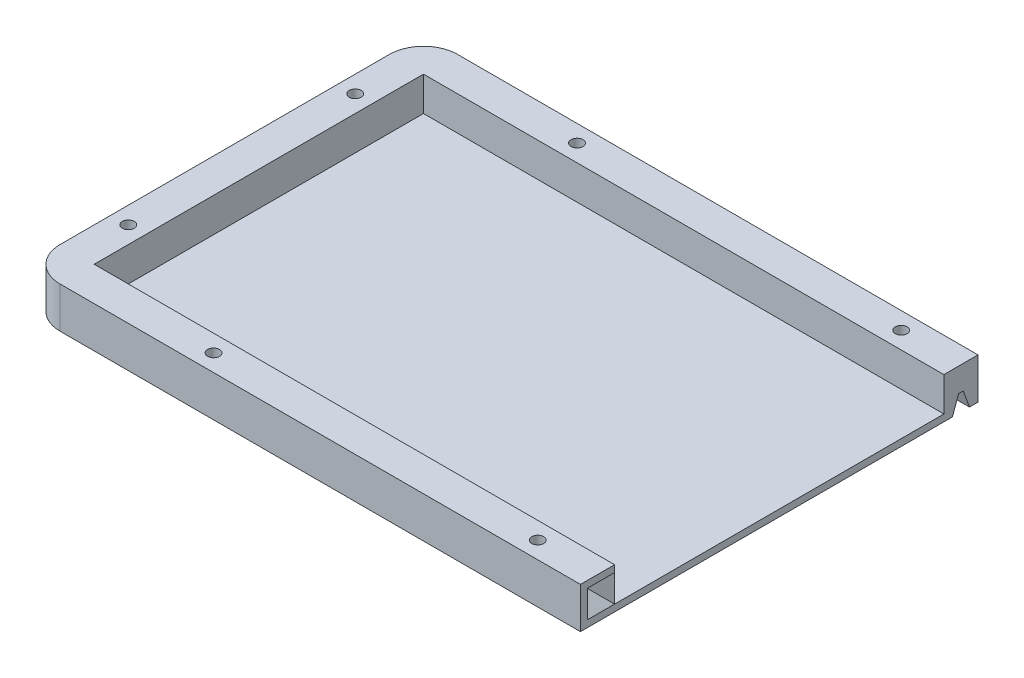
ISO-10303-21;
HEADER;
FILE_DESCRIPTION(('STEP AP214'),'2;1');
FILE_NAME('part.step','',(''),(''),'','','');
FILE_SCHEMA(('AUTOMOTIVE_DESIGN { 1 0 10303 214 1 1 1 1 }'));
ENDSEC;
DATA;
#1=APPLICATION_CONTEXT('core data for automotive mechanical design processes');
#2=APPLICATION_PROTOCOL_DEFINITION('international standard','automotive_design',2000,#1);
#3=PRODUCT_CONTEXT('',#1,'mechanical');
#4=PRODUCT('Part','Part','',(#3));
#5=PRODUCT_RELATED_PRODUCT_CATEGORY('part','',(#4));
#6=PRODUCT_DEFINITION_FORMATION('','',#4);
#7=PRODUCT_DEFINITION_CONTEXT('part definition',#1,'design');
#8=PRODUCT_DEFINITION('design','',#6,#7);
#9=PRODUCT_DEFINITION_SHAPE('','',#8);
#10=(LENGTH_UNIT() NAMED_UNIT(*) SI_UNIT(.MILLI.,.METRE.));
#11=(NAMED_UNIT(*) PLANE_ANGLE_UNIT() SI_UNIT($,.RADIAN.));
#12=(NAMED_UNIT(*) SI_UNIT($,.STERADIAN.) SOLID_ANGLE_UNIT());
#13=UNCERTAINTY_MEASURE_WITH_UNIT(LENGTH_MEASURE(1.E-05),#10,'distance_accuracy_value','');
#14=(GEOMETRIC_REPRESENTATION_CONTEXT(3) GLOBAL_UNCERTAINTY_ASSIGNED_CONTEXT((#13)) GLOBAL_UNIT_ASSIGNED_CONTEXT((#10,
#11,#12)) REPRESENTATION_CONTEXT('',''));
#15=CARTESIAN_POINT('',(0.,0.,0.));
#16=DIRECTION('',(0.,0.,1.));
#17=DIRECTION('',(1.,0.,0.));
#18=AXIS2_PLACEMENT_3D('',#15,#16,#17);
#19=CARTESIAN_POINT('',(162.5,2.,0.));
#20=DIRECTION('',(-1.,0.,0.));
#21=DIRECTION('',(0.,0.,1.));
#22=AXIS2_PLACEMENT_3D('',#19,#20,#21);
#23=PLANE('',#22);
#24=DIRECTION('',(0.,0.,1.));
#25=VECTOR('',#24,1.);
#26=CARTESIAN_POINT('',(162.5,5.,-109.));
#27=LINE('',#26,#25);
#28=CARTESIAN_POINT('',(162.5,5.,-112.180148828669));
#29=VERTEX_POINT('',#28);
#30=CARTESIAN_POINT('',(162.5,5.,-110.819851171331));
#31=VERTEX_POINT('',#30);
#32=EDGE_CURVE('E258',#29,#31,#27,.T.);
#33=ORIENTED_EDGE('',*,*,#32,.F.);
#34=DIRECTION('',(0.,0.939692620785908,0.342020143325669));
#35=VECTOR('',#34,1.);
#36=CARTESIAN_POINT('',(162.5,38.4049381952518,-100.021745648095));
#37=LINE('',#36,#35);
#38=CARTESIAN_POINT('',(162.5,0.,-114.));
#39=VERTEX_POINT('',#38);
#40=EDGE_CURVE('E43',#29,#39,#37,.F.);
#41=ORIENTED_EDGE('',*,*,#40,.T.);
#42=DIRECTION('',(0.,0.,-1.));
#43=VECTOR('',#42,1.);
#44=CARTESIAN_POINT('',(162.5,0.,0.));
#45=LINE('',#44,#43);
#46=CARTESIAN_POINT('',(162.5,0.,-116.5));
#47=VERTEX_POINT('',#46);
#48=EDGE_CURVE('E420',#39,#47,#45,.T.);
#49=ORIENTED_EDGE('',*,*,#48,.T.);
#50=DIRECTION('',(0.,-1.,0.));
#51=VECTOR('',#50,1.);
#52=CARTESIAN_POINT('',(162.5,2.,-116.5));
#53=LINE('',#52,#51);
#54=CARTESIAN_POINT('',(162.5,12.,-116.5));
#55=VERTEX_POINT('',#54);
#56=EDGE_CURVE('E414',#55,#47,#53,.T.);
#57=ORIENTED_EDGE('',*,*,#56,.F.);
#58=DIRECTION('',(0.,0.,1.));
#59=VECTOR('',#58,1.);
#60=CARTESIAN_POINT('',(162.5,12.,-116.5));
#61=LINE('',#60,#59);
#62=CARTESIAN_POINT('',(162.5,12.,-106.5));
#63=VERTEX_POINT('',#62);
#64=EDGE_CURVE('E388',#55,#63,#61,.T.);
#65=ORIENTED_EDGE('',*,*,#64,.T.);
#66=DIRECTION('',(0.,-1.,0.));
#67=VECTOR('',#66,1.);
#68=CARTESIAN_POINT('',(162.5,12.,-106.5));
#69=LINE('',#68,#67);
#70=CARTESIAN_POINT('',(162.5,2.,-106.5));
#71=VERTEX_POINT('',#70);
#72=EDGE_CURVE('E394',#63,#71,#69,.T.);
#73=ORIENTED_EDGE('',*,*,#72,.T.);
#74=DIRECTION('',(0.,0.,-1.));
#75=VECTOR('',#74,1.);
#76=CARTESIAN_POINT('',(162.5,2.,0.));
#77=LINE('',#76,#75);
#78=CARTESIAN_POINT('',(162.5,2.,-10.));
#79=VERTEX_POINT('',#78);
#80=EDGE_CURVE('E411',#79,#71,#77,.T.);
#81=ORIENTED_EDGE('',*,*,#80,.F.);
#82=DIRECTION('',(0.,0.,-1.));
#83=VECTOR('',#82,1.);
#84=CARTESIAN_POINT('',(162.5,2.,0.));
#85=LINE('',#84,#83);
#86=CARTESIAN_POINT('',(162.5,2.,-2.));
#87=VERTEX_POINT('',#86);
#88=EDGE_CURVE('E360',#87,#79,#85,.T.);
#89=ORIENTED_EDGE('',*,*,#88,.F.);
#90=DIRECTION('',(0.,-1.,0.));
#91=VECTOR('',#90,1.);
#92=CARTESIAN_POINT('',(162.5,0.,-2.));
#93=LINE('',#92,#91);
#94=CARTESIAN_POINT('',(162.5,10.,-2.));
#95=VERTEX_POINT('',#94);
#96=EDGE_CURVE('E357',#95,#87,#93,.T.);
#97=ORIENTED_EDGE('',*,*,#96,.F.);
#98=DIRECTION('',(0.,0.,-1.));
#99=VECTOR('',#98,1.);
#100=CARTESIAN_POINT('',(162.5,10.,0.));
#101=LINE('',#100,#99);
#102=CARTESIAN_POINT('',(162.5,10.,-10.));
#103=VERTEX_POINT('',#102);
#104=EDGE_CURVE('E365',#95,#103,#101,.T.);
#105=ORIENTED_EDGE('',*,*,#104,.T.);
#106=DIRECTION('',(0.,-1.,0.));
#107=VECTOR('',#106,1.);
#108=CARTESIAN_POINT('',(162.5,12.,-10.));
#109=LINE('',#108,#107);
#110=CARTESIAN_POINT('',(162.5,12.,-10.));
#111=VERTEX_POINT('',#110);
#112=EDGE_CURVE('E407',#111,#103,#109,.T.);
#113=ORIENTED_EDGE('',*,*,#112,.F.);
#114=DIRECTION('',(0.,0.,1.));
#115=VECTOR('',#114,1.);
#116=CARTESIAN_POINT('',(162.5,12.,-10.));
#117=LINE('',#116,#115);
#118=CARTESIAN_POINT('',(162.5,12.,0.));
#119=VERTEX_POINT('',#118);
#120=EDGE_CURVE('E208',#111,#119,#117,.T.);
#121=ORIENTED_EDGE('',*,*,#120,.T.);
#122=DIRECTION('',(0.,-1.,0.));
#123=VECTOR('',#122,1.);
#124=CARTESIAN_POINT('',(162.5,2.,0.));
#125=LINE('',#124,#123);
#126=CARTESIAN_POINT('',(162.5,0.,0.));
#127=VERTEX_POINT('',#126);
#128=EDGE_CURVE('E206',#119,#127,#125,.T.);
#129=ORIENTED_EDGE('',*,*,#128,.T.);
#130=CARTESIAN_POINT('',(162.5,0.,-109.));
#131=VERTEX_POINT('',#130);
#132=EDGE_CURVE('E421',#127,#131,#45,.T.);
#133=ORIENTED_EDGE('',*,*,#132,.T.);
#134=DIRECTION('',(0.,0.939692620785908,-0.342020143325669));
#135=VECTOR('',#134,1.);
#136=CARTESIAN_POINT('',(162.5,0.,-109.));
#137=LINE('',#136,#135);
#138=EDGE_CURVE('E58',#31,#131,#137,.F.);
#139=ORIENTED_EDGE('',*,*,#138,.F.);
#140=EDGE_LOOP('',(#33,#41,#49,#57,#65,#73,#81,#89,#97,#105,#113,#121,#129,#133,#139));
#141=FACE_BOUND('',#140,.T.);
#142=ADVANCED_FACE('F39',(#141),#23,.F.);
#143=CARTESIAN_POINT('',(0.,2.,0.));
#144=DIRECTION('',(1.,0.,0.));
#145=DIRECTION('',(0.,0.,-1.));
#146=AXIS2_PLACEMENT_3D('',#143,#144,#145);
#147=PLANE('',#146);
#148=DIRECTION('',(0.,0.,1.));
#149=VECTOR('',#148,1.);
#150=CARTESIAN_POINT('',(0.,12.,-111.5));
#151=LINE('',#150,#149);
#152=CARTESIAN_POINT('',(0.,12.,-106.5));
#153=VERTEX_POINT('',#152);
#154=CARTESIAN_POINT('',(0.,12.,-9.99999999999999));
#155=VERTEX_POINT('',#154);
#156=EDGE_CURVE('E193',#153,#155,#151,.T.);
#157=ORIENTED_EDGE('',*,*,#156,.F.);
#158=DIRECTION('',(0.,-1.,0.));
#159=VECTOR('',#158,1.);
#160=CARTESIAN_POINT('',(0.,2.,-106.5));
#161=LINE('',#160,#159);
#162=CARTESIAN_POINT('',(0.,0.,-106.5));
#163=VERTEX_POINT('',#162);
#164=EDGE_CURVE('E430',#153,#163,#161,.T.);
#165=ORIENTED_EDGE('',*,*,#164,.T.);
#166=DIRECTION('',(0.,0.,1.));
#167=VECTOR('',#166,1.);
#168=CARTESIAN_POINT('',(0.,0.,0.));
#169=LINE('',#168,#167);
#170=CARTESIAN_POINT('',(0.,0.,-10.));
#171=VERTEX_POINT('',#170);
#172=EDGE_CURVE('E410',#163,#171,#169,.T.);
#173=ORIENTED_EDGE('',*,*,#172,.T.);
#174=DIRECTION('',(0.,-1.,0.));
#175=VECTOR('',#174,1.);
#176=CARTESIAN_POINT('',(0.,2.,-10.));
#177=LINE('',#176,#175);
#178=EDGE_CURVE('E428',#171,#155,#177,.F.);
#179=ORIENTED_EDGE('',*,*,#178,.T.);
#180=EDGE_LOOP('',(#157,#165,#173,#179));
#181=FACE_BOUND('',#180,.T.);
#182=ADVANCED_FACE('F448',(#181),#147,.F.);
#183=CARTESIAN_POINT('',(0.,2.,0.));
#184=DIRECTION('',(0.,0.,-1.));
#185=DIRECTION('',(-1.,0.,0.));
#186=AXIS2_PLACEMENT_3D('',#183,#184,#185);
#187=PLANE('',#186);
#188=DIRECTION('',(1.,0.,0.));
#189=VECTOR('',#188,1.);
#190=CARTESIAN_POINT('',(5.00000000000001,12.,0.));
#191=LINE('',#190,#189);
#192=CARTESIAN_POINT('',(10.,12.,0.));
#193=VERTEX_POINT('',#192);
#194=EDGE_CURVE('E190',#193,#119,#191,.T.);
#195=ORIENTED_EDGE('',*,*,#194,.F.);
#196=DIRECTION('',(0.,-1.,0.));
#197=VECTOR('',#196,1.);
#198=CARTESIAN_POINT('',(10.,2.,0.));
#199=LINE('',#198,#197);
#200=CARTESIAN_POINT('',(10.,0.,0.));
#201=VERTEX_POINT('',#200);
#202=EDGE_CURVE('E203',#193,#201,#199,.T.);
#203=ORIENTED_EDGE('',*,*,#202,.T.);
#204=DIRECTION('',(1.,0.,0.));
#205=VECTOR('',#204,1.);
#206=CARTESIAN_POINT('',(0.,0.,0.));
#207=LINE('',#206,#205);
#208=EDGE_CURVE('E418',#201,#127,#207,.T.);
#209=ORIENTED_EDGE('',*,*,#208,.T.);
#210=ORIENTED_EDGE('',*,*,#128,.F.);
#211=EDGE_LOOP('',(#195,#203,#209,#210));
#212=FACE_BOUND('',#211,.T.);
#213=ADVANCED_FACE('F202',(#212),#187,.F.);
#214=CARTESIAN_POINT('',(0.,2.,-116.5));
#215=DIRECTION('',(0.,0.,1.));
#216=DIRECTION('',(1.,0.,0.));
#217=AXIS2_PLACEMENT_3D('',#214,#215,#216);
#218=PLANE('',#217);
#219=DIRECTION('',(-1.,0.,0.));
#220=VECTOR('',#219,1.);
#221=CARTESIAN_POINT('',(0.,0.,-116.5));
#222=LINE('',#221,#220);
#223=CARTESIAN_POINT('',(10.,0.,-116.5));
#224=VERTEX_POINT('',#223);
#225=EDGE_CURVE('E415',#47,#224,#222,.T.);
#226=ORIENTED_EDGE('',*,*,#225,.T.);
#227=DIRECTION('',(0.,-1.,0.));
#228=VECTOR('',#227,1.);
#229=CARTESIAN_POINT('',(10.,2.,-116.5));
#230=LINE('',#229,#228);
#231=CARTESIAN_POINT('',(10.,12.,-116.5));
#232=VERTEX_POINT('',#231);
#233=EDGE_CURVE('E198',#224,#232,#230,.F.);
#234=ORIENTED_EDGE('',*,*,#233,.T.);
#235=DIRECTION('',(-1.,0.,0.));
#236=VECTOR('',#235,1.);
#237=CARTESIAN_POINT('',(162.5,12.,-116.5));
#238=LINE('',#237,#236);
#239=EDGE_CURVE('E391',#55,#232,#238,.T.);
#240=ORIENTED_EDGE('',*,*,#239,.F.);
#241=ORIENTED_EDGE('',*,*,#56,.T.);
#242=EDGE_LOOP('',(#226,#234,#240,#241));
#243=FACE_BOUND('',#242,.T.);
#244=ADVANCED_FACE('F439',(#243),#218,.F.);
#245=CARTESIAN_POINT('',(0.,2.,0.));
#246=DIRECTION('',(0.,-1.,0.));
#247=DIRECTION('',(0.,0.,-1.));
#248=AXIS2_PLACEMENT_3D('',#245,#246,#247);
#249=PLANE('',#248);
#250=ORIENTED_EDGE('',*,*,#80,.T.);
#251=DIRECTION('',(-1.,0.,0.));
#252=VECTOR('',#251,1.);
#253=CARTESIAN_POINT('',(162.5,2.,-106.5));
#254=LINE('',#253,#252);
#255=CARTESIAN_POINT('',(10.,2.,-106.5));
#256=VERTEX_POINT('',#255);
#257=EDGE_CURVE('E209',#71,#256,#254,.T.);
#258=ORIENTED_EDGE('',*,*,#257,.T.);
#259=DIRECTION('',(0.,0.,1.));
#260=VECTOR('',#259,1.);
#261=CARTESIAN_POINT('',(10.,2.,-111.5));
#262=LINE('',#261,#260);
#263=CARTESIAN_POINT('',(10.,2.,-10.));
#264=VERTEX_POINT('',#263);
#265=EDGE_CURVE('E397',#256,#264,#262,.T.);
#266=ORIENTED_EDGE('',*,*,#265,.T.);
#267=DIRECTION('',(1.,0.,0.));
#268=VECTOR('',#267,1.);
#269=CARTESIAN_POINT('',(5.00000000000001,2.,-10.));
#270=LINE('',#269,#268);
#271=EDGE_CURVE('E371',#264,#79,#270,.T.);
#272=ORIENTED_EDGE('',*,*,#271,.T.);
#273=EDGE_LOOP('',(#250,#258,#266,#272));
#274=FACE_BOUND('',#273,.T.);
#275=ADVANCED_FACE('F653',(#274),#249,.F.);
#276=CARTESIAN_POINT('',(0.,0.,0.));
#277=DIRECTION('',(0.,-1.,0.));
#278=DIRECTION('',(0.,0.,-1.));
#279=AXIS2_PLACEMENT_3D('',#276,#277,#278);
#280=PLANE('',#279);
#281=DIRECTION('',(1.,0.,0.));
#282=VECTOR('',#281,1.);
#283=CARTESIAN_POINT('',(162.5,0.,-114.));
#284=LINE('',#283,#282);
#285=CARTESIAN_POINT('',(150.,0.,-114.));
#286=VERTEX_POINT('',#285);
#287=EDGE_CURVE('E266',#286,#39,#284,.T.);
#288=ORIENTED_EDGE('',*,*,#287,.F.);
#289=DIRECTION('',(0.,0.,-1.));
#290=VECTOR('',#289,1.);
#291=CARTESIAN_POINT('',(150.,0.,-109.));
#292=LINE('',#291,#290);
#293=CARTESIAN_POINT('',(150.,0.,-109.));
#294=VERTEX_POINT('',#293);
#295=EDGE_CURVE('E268',#294,#286,#292,.T.);
#296=ORIENTED_EDGE('',*,*,#295,.F.);
#297=DIRECTION('',(-1.,0.,0.));
#298=VECTOR('',#297,1.);
#299=CARTESIAN_POINT('',(162.5,0.,-109.));
#300=LINE('',#299,#298);
#301=EDGE_CURVE('E271',#131,#294,#300,.T.);
#302=ORIENTED_EDGE('',*,*,#301,.F.);
#303=ORIENTED_EDGE('',*,*,#132,.F.);
#304=ORIENTED_EDGE('',*,*,#208,.F.);
#305=CARTESIAN_POINT('',(10.,0.,-10.));
#306=DIRECTION('',(0.,-1.,0.));
#307=DIRECTION('',(0.,0.,-1.));
#308=AXIS2_PLACEMENT_3D('',#305,#306,#307);
#309=CIRCLE('',#308,10.);
#310=EDGE_CURVE('E212',#201,#171,#309,.T.);
#311=ORIENTED_EDGE('',*,*,#310,.T.);
#312=ORIENTED_EDGE('',*,*,#172,.F.);
#313=CARTESIAN_POINT('',(10.,0.,-106.5));
#314=DIRECTION('',(0.,-1.,0.));
#315=DIRECTION('',(0.,0.,-1.));
#316=AXIS2_PLACEMENT_3D('',#313,#314,#315);
#317=CIRCLE('',#316,10.);
#318=EDGE_CURVE('E434',#163,#224,#317,.T.);
#319=ORIENTED_EDGE('',*,*,#318,.T.);
#320=ORIENTED_EDGE('',*,*,#225,.F.);
#321=ORIENTED_EDGE('',*,*,#48,.F.);
#322=EDGE_LOOP('',(#288,#296,#302,#303,#304,#311,#312,#319,#320,#321));
#323=FACE_BOUND('',#322,.T.);
#324=DIRECTION('',(0.,0.,1.));
#325=VECTOR('',#324,1.);
#326=CARTESIAN_POINT('',(137.5,0.,-7.5));
#327=LINE('',#326,#325);
#328=CARTESIAN_POINT('',(137.5,0.,-7.5));
#329=VERTEX_POINT('',#328);
#330=CARTESIAN_POINT('',(137.5,0.,-2.5));
#331=VERTEX_POINT('',#330);
#332=EDGE_CURVE('E274',#329,#331,#327,.T.);
#333=ORIENTED_EDGE('',*,*,#332,.F.);
#334=DIRECTION('',(1.,0.,0.));
#335=VECTOR('',#334,1.);
#336=CARTESIAN_POINT('',(87.5,0.,-7.5));
#337=LINE('',#336,#335);
#338=CARTESIAN_POINT('',(87.5,0.,-7.5));
#339=VERTEX_POINT('',#338);
#340=EDGE_CURVE('E280',#339,#329,#337,.T.);
#341=ORIENTED_EDGE('',*,*,#340,.F.);
#342=DIRECTION('',(0.,0.,-1.));
#343=VECTOR('',#342,1.);
#344=CARTESIAN_POINT('',(87.5,0.,-7.5));
#345=LINE('',#344,#343);
#346=CARTESIAN_POINT('',(87.5,0.,-2.5));
#347=VERTEX_POINT('',#346);
#348=EDGE_CURVE('E278',#347,#339,#345,.T.);
#349=ORIENTED_EDGE('',*,*,#348,.F.);
#350=DIRECTION('',(-1.,0.,0.));
#351=VECTOR('',#350,1.);
#352=CARTESIAN_POINT('',(87.5,0.,-2.5));
#353=LINE('',#352,#351);
#354=EDGE_CURVE('E276',#331,#347,#353,.T.);
#355=ORIENTED_EDGE('',*,*,#354,.F.);
#356=EDGE_LOOP('',(#333,#341,#349,#355));
#357=FACE_BOUND('',#356,.T.);
#358=CARTESIAN_POINT('',(5.00000000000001,0.,-91.5));
#359=DIRECTION('',(0.,-1.,0.));
#360=DIRECTION('',(0.,0.,1.));
#361=AXIS2_PLACEMENT_3D('',#358,#359,#360);
#362=CIRCLE('',#361,3.);
#363=CARTESIAN_POINT('',(5.00000000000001,0.,-88.5));
#364=VERTEX_POINT('',#363);
#365=EDGE_CURVE('E337',#364,#364,#362,.T.);
#366=ORIENTED_EDGE('',*,*,#365,.F.);
#367=EDGE_LOOP('',(#366));
#368=FACE_BOUND('',#367,.T.);
#369=CARTESIAN_POINT('',(50.,0.,-111.5));
#370=DIRECTION('',(0.,-1.,0.));
#371=DIRECTION('',(0.,0.,1.));
#372=AXIS2_PLACEMENT_3D('',#369,#370,#371);
#373=CIRCLE('',#372,2.99999999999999);
#374=CARTESIAN_POINT('',(50.,0.,-108.5));
#375=VERTEX_POINT('',#374);
#376=EDGE_CURVE('E350',#375,#375,#373,.T.);
#377=ORIENTED_EDGE('',*,*,#376,.F.);
#378=EDGE_LOOP('',(#377));
#379=FACE_BOUND('',#378,.T.);
#380=CARTESIAN_POINT('',(145.,0.,-111.5));
#381=DIRECTION('',(0.,-1.,0.));
#382=DIRECTION('',(0.,0.,1.));
#383=AXIS2_PLACEMENT_3D('',#380,#381,#382);
#384=CIRCLE('',#383,2.99999999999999);
#385=CARTESIAN_POINT('',(145.,0.,-108.5));
#386=VERTEX_POINT('',#385);
#387=EDGE_CURVE('E347',#386,#386,#384,.T.);
#388=ORIENTED_EDGE('',*,*,#387,.F.);
#389=EDGE_LOOP('',(#388));
#390=FACE_BOUND('',#389,.T.);
#391=CARTESIAN_POINT('',(145.,0.,-5.));
#392=DIRECTION('',(0.,-1.,0.));
#393=DIRECTION('',(0.,0.,-1.));
#394=AXIS2_PLACEMENT_3D('',#391,#392,#393);
#395=CIRCLE('',#394,2.99999999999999);
#396=CARTESIAN_POINT('',(145.,0.,-7.99999999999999));
#397=VERTEX_POINT('',#396);
#398=EDGE_CURVE('E344',#397,#397,#395,.T.);
#399=ORIENTED_EDGE('',*,*,#398,.F.);
#400=EDGE_LOOP('',(#399));
#401=FACE_BOUND('',#400,.T.);
#402=CARTESIAN_POINT('',(50.,0.,-5.));
#403=DIRECTION('',(0.,-1.,0.));
#404=DIRECTION('',(0.,0.,-1.));
#405=AXIS2_PLACEMENT_3D('',#402,#403,#404);
#406=CIRCLE('',#405,3.);
#407=CARTESIAN_POINT('',(50.,0.,-8.));
#408=VERTEX_POINT('',#407);
#409=EDGE_CURVE('E340',#408,#408,#406,.T.);
#410=ORIENTED_EDGE('',*,*,#409,.F.);
#411=EDGE_LOOP('',(#410));
#412=FACE_BOUND('',#411,.T.);
#413=CARTESIAN_POINT('',(5.00000000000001,0.,-25.));
#414=DIRECTION('',(0.,-1.,0.));
#415=DIRECTION('',(0.,0.,-1.));
#416=AXIS2_PLACEMENT_3D('',#413,#414,#415);
#417=CIRCLE('',#416,3.);
#418=CARTESIAN_POINT('',(5.00000000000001,0.,-28.));
#419=VERTEX_POINT('',#418);
#420=EDGE_CURVE('E343',#419,#419,#417,.T.);
#421=ORIENTED_EDGE('',*,*,#420,.F.);
#422=EDGE_LOOP('',(#421));
#423=FACE_BOUND('',#422,.T.);
#424=ADVANCED_FACE('F451',(#323,#357,#368,#379,#390,#401,#412,#423),#280,.T.);
#425=CARTESIAN_POINT('',(5.00000000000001,12.,-10.));
#426=DIRECTION('',(0.,0.,-1.));
#427=DIRECTION('',(-1.,0.,0.));
#428=AXIS2_PLACEMENT_3D('',#425,#426,#427);
#429=PLANE('',#428);
#430=ORIENTED_EDGE('',*,*,#271,.F.);
#431=DIRECTION('',(0.,-1.,0.));
#432=VECTOR('',#431,1.);
#433=CARTESIAN_POINT('',(10.,12.,-10.));
#434=LINE('',#433,#432);
#435=CARTESIAN_POINT('',(10.,12.,-10.));
#436=VERTEX_POINT('',#435);
#437=EDGE_CURVE('E405',#436,#264,#434,.T.);
#438=ORIENTED_EDGE('',*,*,#437,.F.);
#439=DIRECTION('',(1.,0.,0.));
#440=VECTOR('',#439,1.);
#441=CARTESIAN_POINT('',(5.00000000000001,12.,-10.));
#442=LINE('',#441,#440);
#443=EDGE_CURVE('E379',#436,#111,#442,.T.);
#444=ORIENTED_EDGE('',*,*,#443,.T.);
#445=ORIENTED_EDGE('',*,*,#112,.T.);
#446=DIRECTION('',(0.,1.,0.));
#447=VECTOR('',#446,1.);
#448=CARTESIAN_POINT('',(162.5,0.,-10.));
#449=LINE('',#448,#447);
#450=EDGE_CURVE('E362',#79,#103,#449,.T.);
#451=ORIENTED_EDGE('',*,*,#450,.F.);
#452=EDGE_LOOP('',(#430,#438,#444,#445,#451));
#453=FACE_BOUND('',#452,.T.);
#454=ADVANCED_FACE('F458',(#453),#429,.T.);
#455=CARTESIAN_POINT('',(10.,12.,-111.5));
#456=DIRECTION('',(1.,0.,0.));
#457=DIRECTION('',(0.,0.,-1.));
#458=AXIS2_PLACEMENT_3D('',#455,#456,#457);
#459=PLANE('',#458);
#460=ORIENTED_EDGE('',*,*,#265,.F.);
#461=DIRECTION('',(0.,-1.,0.));
#462=VECTOR('',#461,1.);
#463=CARTESIAN_POINT('',(10.,12.,-106.5));
#464=LINE('',#463,#462);
#465=CARTESIAN_POINT('',(10.,12.,-106.5));
#466=VERTEX_POINT('',#465);
#467=EDGE_CURVE('E403',#466,#256,#464,.T.);
#468=ORIENTED_EDGE('',*,*,#467,.F.);
#469=DIRECTION('',(0.,0.,1.));
#470=VECTOR('',#469,1.);
#471=CARTESIAN_POINT('',(10.,12.,-111.5));
#472=LINE('',#471,#470);
#473=EDGE_CURVE('E382',#466,#436,#472,.T.);
#474=ORIENTED_EDGE('',*,*,#473,.T.);
#475=ORIENTED_EDGE('',*,*,#437,.T.);
#476=EDGE_LOOP('',(#460,#468,#474,#475));
#477=FACE_BOUND('',#476,.T.);
#478=ADVANCED_FACE('F462',(#477),#459,.T.);
#479=CARTESIAN_POINT('',(162.5,12.,-106.5));
#480=DIRECTION('',(0.,0.,1.));
#481=DIRECTION('',(1.,0.,0.));
#482=AXIS2_PLACEMENT_3D('',#479,#480,#481);
#483=PLANE('',#482);
#484=ORIENTED_EDGE('',*,*,#257,.F.);
#485=ORIENTED_EDGE('',*,*,#72,.F.);
#486=DIRECTION('',(1.,0.,0.));
#487=VECTOR('',#486,1.);
#488=CARTESIAN_POINT('',(19.,12.,-106.5));
#489=LINE('',#488,#487);
#490=EDGE_CURVE('E385',#63,#466,#489,.F.);
#491=ORIENTED_EDGE('',*,*,#490,.T.);
#492=ORIENTED_EDGE('',*,*,#467,.T.);
#493=EDGE_LOOP('',(#484,#485,#491,#492));
#494=FACE_BOUND('',#493,.T.);
#495=ADVANCED_FACE('F466',(#494),#483,.T.);
#496=CARTESIAN_POINT('',(0.,12.,0.));
#497=DIRECTION('',(0.,-1.,0.));
#498=DIRECTION('',(-1.,0.,0.));
#499=AXIS2_PLACEMENT_3D('',#496,#497,#498);
#500=PLANE('',#499);
#501=CARTESIAN_POINT('',(5.00000000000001,12.,-91.5));
#502=DIRECTION('',(0.,-1.,0.));
#503=DIRECTION('',(0.,0.,-1.));
#504=AXIS2_PLACEMENT_3D('',#501,#502,#503);
#505=CIRCLE('',#504,1.75);
#506=CARTESIAN_POINT('',(5.00000000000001,12.,-93.25));
#507=VERTEX_POINT('',#506);
#508=EDGE_CURVE('E310',#507,#507,#505,.T.);
#509=ORIENTED_EDGE('',*,*,#508,.T.);
#510=EDGE_LOOP('',(#509));
#511=FACE_BOUND('',#510,.T.);
#512=CARTESIAN_POINT('',(50.,12.,-111.5));
#513=DIRECTION('',(0.,-1.,0.));
#514=DIRECTION('',(0.,0.,-1.));
#515=AXIS2_PLACEMENT_3D('',#512,#513,#514);
#516=CIRCLE('',#515,1.75);
#517=CARTESIAN_POINT('',(50.,12.,-113.25));
#518=VERTEX_POINT('',#517);
#519=EDGE_CURVE('E317',#518,#518,#516,.T.);
#520=ORIENTED_EDGE('',*,*,#519,.T.);
#521=EDGE_LOOP('',(#520));
#522=FACE_BOUND('',#521,.T.);
#523=CARTESIAN_POINT('',(145.,12.,-111.5));
#524=DIRECTION('',(0.,-1.,0.));
#525=DIRECTION('',(0.,0.,-1.));
#526=AXIS2_PLACEMENT_3D('',#523,#524,#525);
#527=CIRCLE('',#526,1.75000000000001);
#528=CARTESIAN_POINT('',(145.,12.,-113.25));
#529=VERTEX_POINT('',#528);
#530=EDGE_CURVE('E323',#529,#529,#527,.T.);
#531=ORIENTED_EDGE('',*,*,#530,.T.);
#532=EDGE_LOOP('',(#531));
#533=FACE_BOUND('',#532,.T.);
#534=CARTESIAN_POINT('',(145.,12.,-5.));
#535=DIRECTION('',(0.,-1.,0.));
#536=DIRECTION('',(0.,0.,-1.));
#537=AXIS2_PLACEMENT_3D('',#534,#535,#536);
#538=CIRCLE('',#537,1.75000000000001);
#539=CARTESIAN_POINT('',(145.,12.,-6.75000000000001));
#540=VERTEX_POINT('',#539);
#541=EDGE_CURVE('E329',#540,#540,#538,.T.);
#542=ORIENTED_EDGE('',*,*,#541,.T.);
#543=EDGE_LOOP('',(#542));
#544=FACE_BOUND('',#543,.T.);
#545=CARTESIAN_POINT('',(50.,12.,-5.));
#546=DIRECTION('',(0.,-1.,0.));
#547=DIRECTION('',(0.,0.,-1.));
#548=AXIS2_PLACEMENT_3D('',#545,#546,#547);
#549=CIRCLE('',#548,1.75);
#550=CARTESIAN_POINT('',(50.,12.,-6.75));
#551=VERTEX_POINT('',#550);
#552=EDGE_CURVE('E304',#551,#551,#549,.T.);
#553=ORIENTED_EDGE('',*,*,#552,.T.);
#554=EDGE_LOOP('',(#553));
#555=FACE_BOUND('',#554,.T.);
#556=CARTESIAN_POINT('',(5.00000000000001,12.,-25.));
#557=DIRECTION('',(0.,-1.,0.));
#558=DIRECTION('',(0.,0.,-1.));
#559=AXIS2_PLACEMENT_3D('',#556,#557,#558);
#560=CIRCLE('',#559,1.75);
#561=CARTESIAN_POINT('',(5.00000000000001,12.,-26.75));
#562=VERTEX_POINT('',#561);
#563=EDGE_CURVE('E334',#562,#562,#560,.T.);
#564=ORIENTED_EDGE('',*,*,#563,.T.);
#565=EDGE_LOOP('',(#564));
#566=FACE_BOUND('',#565,.T.);
#567=ORIENTED_EDGE('',*,*,#239,.T.);
#568=CARTESIAN_POINT('',(10.,12.,-106.5));
#569=DIRECTION('',(0.,-1.,0.));
#570=DIRECTION('',(0.,0.,-1.));
#571=AXIS2_PLACEMENT_3D('',#568,#569,#570);
#572=CIRCLE('',#571,10.);
#573=EDGE_CURVE('E197',#232,#153,#572,.F.);
#574=ORIENTED_EDGE('',*,*,#573,.T.);
#575=ORIENTED_EDGE('',*,*,#156,.T.);
#576=CARTESIAN_POINT('',(10.,12.,-10.));
#577=DIRECTION('',(0.,-1.,0.));
#578=DIRECTION('',(0.,0.,-1.));
#579=AXIS2_PLACEMENT_3D('',#576,#577,#578);
#580=CIRCLE('',#579,10.);
#581=EDGE_CURVE('E185',#155,#193,#580,.F.);
#582=ORIENTED_EDGE('',*,*,#581,.T.);
#583=ORIENTED_EDGE('',*,*,#194,.T.);
#584=ORIENTED_EDGE('',*,*,#120,.F.);
#585=ORIENTED_EDGE('',*,*,#443,.F.);
#586=ORIENTED_EDGE('',*,*,#473,.F.);
#587=ORIENTED_EDGE('',*,*,#490,.F.);
#588=ORIENTED_EDGE('',*,*,#64,.F.);
#589=EDGE_LOOP('',(#567,#574,#575,#582,#583,#584,#585,#586,#587,#588));
#590=FACE_BOUND('',#589,.T.);
#591=ADVANCED_FACE('F188',(#511,#522,#533,#544,#555,#566,#590),#500,.F.);
#592=CARTESIAN_POINT('',(10.,2.,-106.5));
#593=DIRECTION('',(0.,-1.,0.));
#594=DIRECTION('',(0.,0.,-1.));
#595=AXIS2_PLACEMENT_3D('',#592,#593,#594);
#596=CYLINDRICAL_SURFACE('',#595,10.);
#597=ORIENTED_EDGE('',*,*,#573,.F.);
#598=ORIENTED_EDGE('',*,*,#233,.F.);
#599=ORIENTED_EDGE('',*,*,#318,.F.);
#600=ORIENTED_EDGE('',*,*,#164,.F.);
#601=EDGE_LOOP('',(#597,#598,#599,#600));
#602=FACE_BOUND('',#601,.T.);
#603=ADVANCED_FACE('F445',(#602),#596,.T.);
#604=CARTESIAN_POINT('',(10.,2.,-10.));
#605=DIRECTION('',(0.,-1.,0.));
#606=DIRECTION('',(0.,0.,-1.));
#607=AXIS2_PLACEMENT_3D('',#604,#605,#606);
#608=CYLINDRICAL_SURFACE('',#607,10.);
#609=ORIENTED_EDGE('',*,*,#581,.F.);
#610=ORIENTED_EDGE('',*,*,#178,.F.);
#611=ORIENTED_EDGE('',*,*,#310,.F.);
#612=ORIENTED_EDGE('',*,*,#202,.F.);
#613=EDGE_LOOP('',(#609,#610,#611,#612));
#614=FACE_BOUND('',#613,.T.);
#615=ADVANCED_FACE('F211',(#614),#608,.T.);
#616=CARTESIAN_POINT('',(162.5,0.,-2.));
#617=DIRECTION('',(-0.707106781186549,0.,0.707106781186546));
#618=DIRECTION('',(0.707106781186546,0.,0.707106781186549));
#619=AXIS2_PLACEMENT_3D('',#616,#617,#618);
#620=PLANE('',#619);
#621=ORIENTED_EDGE('',*,*,#96,.T.);
#622=DIRECTION('',(0.577350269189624,-0.577350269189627,0.577350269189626));
#623=VECTOR('',#622,1.);
#624=CARTESIAN_POINT('',(163.166666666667,1.33333333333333,-1.33333333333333));
#625=LINE('',#624,#623);
#626=CARTESIAN_POINT('',(158.5,6.,-6.));
#627=VERTEX_POINT('',#626);
#628=EDGE_CURVE('E368',#627,#87,#625,.T.);
#629=ORIENTED_EDGE('',*,*,#628,.F.);
#630=DIRECTION('',(-0.577350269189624,-0.577350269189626,-0.577350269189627));
#631=VECTOR('',#630,1.);
#632=CARTESIAN_POINT('',(159.166666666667,6.66666666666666,-5.33333333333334));
#633=LINE('',#632,#631);
#634=EDGE_CURVE('E369',#627,#95,#633,.F.);
#635=ORIENTED_EDGE('',*,*,#634,.T.);
#636=EDGE_LOOP('',(#621,#629,#635));
#637=FACE_BOUND('',#636,.T.);
#638=ADVANCED_FACE('F497',(#637),#620,.F.);
#639=CARTESIAN_POINT('',(162.5,10.,0.));
#640=DIRECTION('',(-0.707106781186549,0.707106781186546,0.));
#641=DIRECTION('',(-0.707106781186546,-0.707106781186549,0.));
#642=AXIS2_PLACEMENT_3D('',#639,#640,#641);
#643=PLANE('',#642);
#644=ORIENTED_EDGE('',*,*,#104,.F.);
#645=ORIENTED_EDGE('',*,*,#634,.F.);
#646=DIRECTION('',(-0.577350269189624,-0.577350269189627,0.577350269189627));
#647=VECTOR('',#646,1.);
#648=CARTESIAN_POINT('',(159.166666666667,6.66666666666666,-6.66666666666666));
#649=LINE('',#648,#647);
#650=EDGE_CURVE('E372',#627,#103,#649,.F.);
#651=ORIENTED_EDGE('',*,*,#650,.T.);
#652=EDGE_LOOP('',(#644,#645,#651));
#653=FACE_BOUND('',#652,.T.);
#654=ADVANCED_FACE('F632',(#653),#643,.F.);
#655=CARTESIAN_POINT('',(162.5,0.,-10.));
#656=DIRECTION('',(-0.707106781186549,0.,-0.707106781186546));
#657=DIRECTION('',(-0.707106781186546,0.,0.707106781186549));
#658=AXIS2_PLACEMENT_3D('',#655,#656,#657);
#659=PLANE('',#658);
#660=ORIENTED_EDGE('',*,*,#450,.T.);
#661=ORIENTED_EDGE('',*,*,#650,.F.);
#662=DIRECTION('',(0.577350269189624,-0.577350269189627,-0.577350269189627));
#663=VECTOR('',#662,1.);
#664=CARTESIAN_POINT('',(159.166666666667,5.33333333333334,-6.66666666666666));
#665=LINE('',#664,#663);
#666=EDGE_CURVE('E374',#627,#79,#665,.T.);
#667=ORIENTED_EDGE('',*,*,#666,.T.);
#668=EDGE_LOOP('',(#660,#661,#667));
#669=FACE_BOUND('',#668,.T.);
#670=ADVANCED_FACE('F636',(#669),#659,.F.);
#671=CARTESIAN_POINT('',(162.5,2.,0.));
#672=DIRECTION('',(-0.707106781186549,-0.707106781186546,0.));
#673=DIRECTION('',(0.707106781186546,-0.707106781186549,0.));
#674=AXIS2_PLACEMENT_3D('',#671,#672,#673);
#675=PLANE('',#674);
#676=ORIENTED_EDGE('',*,*,#88,.T.);
#677=ORIENTED_EDGE('',*,*,#666,.F.);
#678=ORIENTED_EDGE('',*,*,#628,.T.);
#679=EDGE_LOOP('',(#676,#677,#678));
#680=FACE_BOUND('',#679,.T.);
#681=ADVANCED_FACE('F628',(#680),#675,.F.);
#682=CARTESIAN_POINT('',(5.00000000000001,9.,-25.));
#683=DIRECTION('',(0.,-1.,0.));
#684=DIRECTION('',(0.,0.,-1.));
#685=AXIS2_PLACEMENT_3D('',#682,#683,#684);
#686=CYLINDRICAL_SURFACE('',#685,3.);
#687=CARTESIAN_POINT('',(5.00000000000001,8.24999999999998,-25.));
#688=DIRECTION('',(0.,-1.,0.));
#689=DIRECTION('',(0.,0.,-1.));
#690=AXIS2_PLACEMENT_3D('',#687,#688,#689);
#691=CIRCLE('',#690,3.);
#692=CARTESIAN_POINT('',(5.00000000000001,8.24999999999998,-28.));
#693=VERTEX_POINT('',#692);
#694=EDGE_CURVE('E216',#693,#693,#691,.F.);
#695=ORIENTED_EDGE('',*,*,#694,.T.);
#696=EDGE_LOOP('',(#695));
#697=FACE_BOUND('',#696,.T.);
#698=ORIENTED_EDGE('',*,*,#420,.T.);
#699=EDGE_LOOP('',(#698));
#700=FACE_BOUND('',#699,.T.);
#701=ADVANCED_FACE('F624',(#697,#700),#686,.F.);
#702=CARTESIAN_POINT('',(5.00000000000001,9.,-25.));
#703=DIRECTION('',(0.,-1.,0.));
#704=DIRECTION('',(0.,0.,-1.));
#705=AXIS2_PLACEMENT_3D('',#702,#703,#704);
#706=PLANE('',#705);
#707=CARTESIAN_POINT('',(5.00000000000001,9.,-25.));
#708=DIRECTION('',(0.,-1.,0.));
#709=DIRECTION('',(0.,0.,-1.));
#710=AXIS2_PLACEMENT_3D('',#707,#708,#709);
#711=CIRCLE('',#710,2.24999999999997);
#712=CARTESIAN_POINT('',(5.00000000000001,9.,-27.25));
#713=VERTEX_POINT('',#712);
#714=EDGE_CURVE('E213',#713,#713,#711,.T.);
#715=ORIENTED_EDGE('',*,*,#714,.T.);
#716=EDGE_LOOP('',(#715));
#717=FACE_BOUND('',#716,.T.);
#718=CARTESIAN_POINT('',(5.00000000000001,9.,-25.));
#719=DIRECTION('',(0.,-1.,0.));
#720=DIRECTION('',(0.,0.,-1.));
#721=AXIS2_PLACEMENT_3D('',#718,#719,#720);
#722=CIRCLE('',#721,1.75);
#723=CARTESIAN_POINT('',(5.00000000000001,9.,-26.75));
#724=VERTEX_POINT('',#723);
#725=EDGE_CURVE('E313',#724,#724,#722,.T.);
#726=ORIENTED_EDGE('',*,*,#725,.F.);
#727=EDGE_LOOP('',(#726));
#728=FACE_BOUND('',#727,.T.);
#729=ADVANCED_FACE('F590',(#717,#728),#706,.T.);
#730=CARTESIAN_POINT('',(50.,9.,-5.));
#731=DIRECTION('',(0.,-1.,0.));
#732=DIRECTION('',(0.,0.,-1.));
#733=AXIS2_PLACEMENT_3D('',#730,#731,#732);
#734=CYLINDRICAL_SURFACE('',#733,3.);
#735=CARTESIAN_POINT('',(50.,8.24999999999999,-5.));
#736=DIRECTION('',(0.,-1.,0.));
#737=DIRECTION('',(0.,0.,-1.));
#738=AXIS2_PLACEMENT_3D('',#735,#736,#737);
#739=CIRCLE('',#738,3.);
#740=CARTESIAN_POINT('',(50.,8.24999999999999,-8.));
#741=VERTEX_POINT('',#740);
#742=EDGE_CURVE('E11',#741,#741,#739,.F.);
#743=ORIENTED_EDGE('',*,*,#742,.T.);
#744=EDGE_LOOP('',(#743));
#745=FACE_BOUND('',#744,.T.);
#746=ORIENTED_EDGE('',*,*,#409,.T.);
#747=EDGE_LOOP('',(#746));
#748=FACE_BOUND('',#747,.T.);
#749=ADVANCED_FACE('F554',(#745,#748),#734,.F.);
#750=CARTESIAN_POINT('',(50.,9.,-5.));
#751=DIRECTION('',(0.,-1.,0.));
#752=DIRECTION('',(0.,0.,-1.));
#753=AXIS2_PLACEMENT_3D('',#750,#751,#752);
#754=PLANE('',#753);
#755=CARTESIAN_POINT('',(50.,9.,-5.));
#756=DIRECTION('',(0.,-1.,0.));
#757=DIRECTION('',(0.,0.,-1.));
#758=AXIS2_PLACEMENT_3D('',#755,#756,#757);
#759=CIRCLE('',#758,2.25);
#760=CARTESIAN_POINT('',(50.,9.,-7.25));
#761=VERTEX_POINT('',#760);
#762=EDGE_CURVE('E49',#761,#761,#759,.T.);
#763=ORIENTED_EDGE('',*,*,#762,.T.);
#764=EDGE_LOOP('',(#763));
#765=FACE_BOUND('',#764,.T.);
#766=CARTESIAN_POINT('',(50.,9.,-5.));
#767=DIRECTION('',(0.,-1.,0.));
#768=DIRECTION('',(0.,0.,-1.));
#769=AXIS2_PLACEMENT_3D('',#766,#767,#768);
#770=CIRCLE('',#769,1.75);
#771=CARTESIAN_POINT('',(50.,9.,-6.75));
#772=VERTEX_POINT('',#771);
#773=EDGE_CURVE('E286',#772,#772,#770,.T.);
#774=ORIENTED_EDGE('',*,*,#773,.F.);
#775=EDGE_LOOP('',(#774));
#776=FACE_BOUND('',#775,.T.);
#777=ADVANCED_FACE('F550',(#765,#776),#754,.T.);
#778=CARTESIAN_POINT('',(145.,9.,-5.));
#779=DIRECTION('',(0.,-1.,0.));
#780=DIRECTION('',(0.,0.,-1.));
#781=AXIS2_PLACEMENT_3D('',#778,#779,#780);
#782=CYLINDRICAL_SURFACE('',#781,2.99999999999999);
#783=CARTESIAN_POINT('',(145.,8.25,-5.));
#784=DIRECTION('',(0.,-1.,0.));
#785=DIRECTION('',(0.,0.,-1.));
#786=AXIS2_PLACEMENT_3D('',#783,#784,#785);
#787=CIRCLE('',#786,2.99999999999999);
#788=CARTESIAN_POINT('',(145.,8.25,-7.99999999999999));
#789=VERTEX_POINT('',#788);
#790=EDGE_CURVE('E243',#789,#789,#787,.F.);
#791=ORIENTED_EDGE('',*,*,#790,.T.);
#792=EDGE_LOOP('',(#791));
#793=FACE_BOUND('',#792,.T.);
#794=ORIENTED_EDGE('',*,*,#398,.T.);
#795=EDGE_LOOP('',(#794));
#796=FACE_BOUND('',#795,.T.);
#797=ADVANCED_FACE('F553',(#793,#796),#782,.F.);
#798=CARTESIAN_POINT('',(145.,9.,-5.));
#799=DIRECTION('',(0.,-1.,0.));
#800=DIRECTION('',(0.,0.,-1.));
#801=AXIS2_PLACEMENT_3D('',#798,#799,#800);
#802=PLANE('',#801);
#803=CARTESIAN_POINT('',(145.,9.,-5.));
#804=DIRECTION('',(0.,-1.,0.));
#805=DIRECTION('',(0.,0.,-1.));
#806=AXIS2_PLACEMENT_3D('',#803,#804,#805);
#807=CIRCLE('',#806,2.25);
#808=CARTESIAN_POINT('',(145.,9.,-7.25));
#809=VERTEX_POINT('',#808);
#810=EDGE_CURVE('E240',#809,#809,#807,.T.);
#811=ORIENTED_EDGE('',*,*,#810,.T.);
#812=EDGE_LOOP('',(#811));
#813=FACE_BOUND('',#812,.T.);
#814=CARTESIAN_POINT('',(145.,9.,-5.));
#815=DIRECTION('',(0.,-1.,0.));
#816=DIRECTION('',(0.,0.,-1.));
#817=AXIS2_PLACEMENT_3D('',#814,#815,#816);
#818=CIRCLE('',#817,1.75000000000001);
#819=CARTESIAN_POINT('',(145.,9.,-6.75000000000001));
#820=VERTEX_POINT('',#819);
#821=EDGE_CURVE('E307',#820,#820,#818,.T.);
#822=ORIENTED_EDGE('',*,*,#821,.F.);
#823=EDGE_LOOP('',(#822));
#824=FACE_BOUND('',#823,.T.);
#825=ADVANCED_FACE('F592',(#813,#824),#802,.T.);
#826=CARTESIAN_POINT('',(145.,9.,-111.5));
#827=DIRECTION('',(0.,-1.,0.));
#828=DIRECTION('',(0.,0.,-1.));
#829=AXIS2_PLACEMENT_3D('',#826,#827,#828);
#830=CYLINDRICAL_SURFACE('',#829,2.99999999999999);
#831=CARTESIAN_POINT('',(145.,8.24999999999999,-111.5));
#832=DIRECTION('',(0.,1.,0.));
#833=DIRECTION('',(0.,0.,1.));
#834=AXIS2_PLACEMENT_3D('',#831,#832,#833);
#835=CIRCLE('',#834,2.99999999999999);
#836=CARTESIAN_POINT('',(145.,8.24999999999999,-114.5));
#837=VERTEX_POINT('',#836);
#838=EDGE_CURVE('E237',#837,#837,#835,.T.);
#839=ORIENTED_EDGE('',*,*,#838,.T.);
#840=EDGE_LOOP('',(#839));
#841=FACE_BOUND('',#840,.T.);
#842=ORIENTED_EDGE('',*,*,#387,.T.);
#843=EDGE_LOOP('',(#842));
#844=FACE_BOUND('',#843,.T.);
#845=ADVANCED_FACE('F595',(#841,#844),#830,.F.);
#846=CARTESIAN_POINT('',(145.,9.,-111.5));
#847=DIRECTION('',(0.,1.,0.));
#848=DIRECTION('',(0.,0.,1.));
#849=AXIS2_PLACEMENT_3D('',#846,#847,#848);
#850=PLANE('',#849);
#851=CARTESIAN_POINT('',(145.,9.,-111.5));
#852=DIRECTION('',(0.,1.,0.));
#853=DIRECTION('',(0.,0.,1.));
#854=AXIS2_PLACEMENT_3D('',#851,#852,#853);
#855=CIRCLE('',#854,2.24999999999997);
#856=CARTESIAN_POINT('',(145.,9.,-113.75));
#857=VERTEX_POINT('',#856);
#858=EDGE_CURVE('E234',#857,#857,#855,.F.);
#859=ORIENTED_EDGE('',*,*,#858,.T.);
#860=EDGE_LOOP('',(#859));
#861=FACE_BOUND('',#860,.T.);
#862=CARTESIAN_POINT('',(145.,9.,-111.5));
#863=DIRECTION('',(0.,-1.,0.));
#864=DIRECTION('',(0.,0.,-1.));
#865=AXIS2_PLACEMENT_3D('',#862,#863,#864);
#866=CIRCLE('',#865,1.75000000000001);
#867=CARTESIAN_POINT('',(145.,9.,-113.25));
#868=VERTEX_POINT('',#867);
#869=EDGE_CURVE('E326',#868,#868,#866,.T.);
#870=ORIENTED_EDGE('',*,*,#869,.F.);
#871=EDGE_LOOP('',(#870));
#872=FACE_BOUND('',#871,.T.);
#873=ADVANCED_FACE('F600',(#861,#872),#850,.F.);
#874=CARTESIAN_POINT('',(50.,9.,-111.5));
#875=DIRECTION('',(0.,-1.,0.));
#876=DIRECTION('',(0.,0.,-1.));
#877=AXIS2_PLACEMENT_3D('',#874,#875,#876);
#878=CYLINDRICAL_SURFACE('',#877,2.99999999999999);
#879=CARTESIAN_POINT('',(50.,8.25000000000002,-111.5));
#880=DIRECTION('',(0.,1.,0.));
#881=DIRECTION('',(0.,0.,1.));
#882=AXIS2_PLACEMENT_3D('',#879,#880,#881);
#883=CIRCLE('',#882,2.99999999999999);
#884=CARTESIAN_POINT('',(50.,8.25000000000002,-114.5));
#885=VERTEX_POINT('',#884);
#886=EDGE_CURVE('E231',#885,#885,#883,.T.);
#887=ORIENTED_EDGE('',*,*,#886,.T.);
#888=EDGE_LOOP('',(#887));
#889=FACE_BOUND('',#888,.T.);
#890=ORIENTED_EDGE('',*,*,#376,.T.);
#891=EDGE_LOOP('',(#890));
#892=FACE_BOUND('',#891,.T.);
#893=ADVANCED_FACE('F603',(#889,#892),#878,.F.);
#894=CARTESIAN_POINT('',(50.,9.,-111.5));
#895=DIRECTION('',(0.,1.,0.));
#896=DIRECTION('',(0.,0.,1.));
#897=AXIS2_PLACEMENT_3D('',#894,#895,#896);
#898=PLANE('',#897);
#899=CARTESIAN_POINT('',(50.,9.,-111.5));
#900=DIRECTION('',(0.,1.,0.));
#901=DIRECTION('',(0.,0.,1.));
#902=AXIS2_PLACEMENT_3D('',#899,#900,#901);
#903=CIRCLE('',#902,2.25);
#904=CARTESIAN_POINT('',(50.,9.,-113.75));
#905=VERTEX_POINT('',#904);
#906=EDGE_CURVE('E228',#905,#905,#903,.F.);
#907=ORIENTED_EDGE('',*,*,#906,.T.);
#908=EDGE_LOOP('',(#907));
#909=FACE_BOUND('',#908,.T.);
#910=CARTESIAN_POINT('',(50.,9.,-111.5));
#911=DIRECTION('',(0.,-1.,0.));
#912=DIRECTION('',(0.,0.,-1.));
#913=AXIS2_PLACEMENT_3D('',#910,#911,#912);
#914=CIRCLE('',#913,1.75);
#915=CARTESIAN_POINT('',(50.,9.,-113.25));
#916=VERTEX_POINT('',#915);
#917=EDGE_CURVE('E320',#916,#916,#914,.T.);
#918=ORIENTED_EDGE('',*,*,#917,.F.);
#919=EDGE_LOOP('',(#918));
#920=FACE_BOUND('',#919,.T.);
#921=ADVANCED_FACE('F608',(#909,#920),#898,.F.);
#922=CARTESIAN_POINT('',(5.00000000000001,9.,-91.5));
#923=DIRECTION('',(0.,-1.,0.));
#924=DIRECTION('',(0.,0.,-1.));
#925=AXIS2_PLACEMENT_3D('',#922,#923,#924);
#926=CYLINDRICAL_SURFACE('',#925,3.);
#927=CARTESIAN_POINT('',(5.00000000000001,8.25000000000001,-91.5));
#928=DIRECTION('',(0.,1.,0.));
#929=DIRECTION('',(0.,0.,1.));
#930=AXIS2_PLACEMENT_3D('',#927,#928,#929);
#931=CIRCLE('',#930,3.);
#932=CARTESIAN_POINT('',(5.00000000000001,8.25000000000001,-88.5));
#933=VERTEX_POINT('',#932);
#934=EDGE_CURVE('E225',#933,#933,#931,.T.);
#935=ORIENTED_EDGE('',*,*,#934,.T.);
#936=EDGE_LOOP('',(#935));
#937=FACE_BOUND('',#936,.T.);
#938=ORIENTED_EDGE('',*,*,#365,.T.);
#939=EDGE_LOOP('',(#938));
#940=FACE_BOUND('',#939,.T.);
#941=ADVANCED_FACE('F611',(#937,#940),#926,.F.);
#942=CARTESIAN_POINT('',(5.00000000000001,9.,-91.5));
#943=DIRECTION('',(0.,1.,0.));
#944=DIRECTION('',(0.,0.,1.));
#945=AXIS2_PLACEMENT_3D('',#942,#943,#944);
#946=PLANE('',#945);
#947=CARTESIAN_POINT('',(5.00000000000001,9.,-91.5));
#948=DIRECTION('',(0.,1.,0.));
#949=DIRECTION('',(0.,0.,1.));
#950=AXIS2_PLACEMENT_3D('',#947,#948,#949);
#951=CIRCLE('',#950,2.25);
#952=CARTESIAN_POINT('',(5.00000000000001,9.,-89.25));
#953=VERTEX_POINT('',#952);
#954=EDGE_CURVE('E222',#953,#953,#951,.F.);
#955=ORIENTED_EDGE('',*,*,#954,.T.);
#956=EDGE_LOOP('',(#955));
#957=FACE_BOUND('',#956,.T.);
#958=CARTESIAN_POINT('',(5.00000000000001,9.,-91.5));
#959=DIRECTION('',(0.,-1.,0.));
#960=DIRECTION('',(0.,0.,-1.));
#961=AXIS2_PLACEMENT_3D('',#958,#959,#960);
#962=CIRCLE('',#961,1.75);
#963=CARTESIAN_POINT('',(5.00000000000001,9.,-93.25));
#964=VERTEX_POINT('',#963);
#965=EDGE_CURVE('E314',#964,#964,#962,.T.);
#966=ORIENTED_EDGE('',*,*,#965,.F.);
#967=EDGE_LOOP('',(#966));
#968=FACE_BOUND('',#967,.T.);
#969=ADVANCED_FACE('F571',(#957,#968),#946,.F.);
#970=CARTESIAN_POINT('',(5.00000000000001,12.,-25.));
#971=DIRECTION('',(0.,-1.,0.));
#972=DIRECTION('',(0.,0.,-1.));
#973=AXIS2_PLACEMENT_3D('',#970,#971,#972);
#974=CYLINDRICAL_SURFACE('',#973,1.75);
#975=ORIENTED_EDGE('',*,*,#563,.F.);
#976=EDGE_LOOP('',(#975));
#977=FACE_BOUND('',#976,.T.);
#978=ORIENTED_EDGE('',*,*,#725,.T.);
#979=EDGE_LOOP('',(#978));
#980=FACE_BOUND('',#979,.T.);
#981=ADVANCED_FACE('F561',(#977,#980),#974,.F.);
#982=CARTESIAN_POINT('',(50.,12.,-5.));
#983=DIRECTION('',(0.,-1.,0.));
#984=DIRECTION('',(0.,0.,-1.));
#985=AXIS2_PLACEMENT_3D('',#982,#983,#984);
#986=CYLINDRICAL_SURFACE('',#985,1.75);
#987=ORIENTED_EDGE('',*,*,#552,.F.);
#988=EDGE_LOOP('',(#987));
#989=FACE_BOUND('',#988,.T.);
#990=ORIENTED_EDGE('',*,*,#773,.T.);
#991=EDGE_LOOP('',(#990));
#992=FACE_BOUND('',#991,.T.);
#993=ADVANCED_FACE('F558',(#989,#992),#986,.F.);
#994=CARTESIAN_POINT('',(145.,12.,-5.));
#995=DIRECTION('',(0.,-1.,0.));
#996=DIRECTION('',(0.,0.,-1.));
#997=AXIS2_PLACEMENT_3D('',#994,#995,#996);
#998=CYLINDRICAL_SURFACE('',#997,1.75000000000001);
#999=ORIENTED_EDGE('',*,*,#541,.F.);
#1000=EDGE_LOOP('',(#999));
#1001=FACE_BOUND('',#1000,.T.);
#1002=ORIENTED_EDGE('',*,*,#821,.T.);
#1003=EDGE_LOOP('',(#1002));
#1004=FACE_BOUND('',#1003,.T.);
#1005=ADVANCED_FACE('F560',(#1001,#1004),#998,.F.);
#1006=CARTESIAN_POINT('',(145.,12.,-111.5));
#1007=DIRECTION('',(0.,-1.,0.));
#1008=DIRECTION('',(0.,0.,-1.));
#1009=AXIS2_PLACEMENT_3D('',#1006,#1007,#1008);
#1010=CYLINDRICAL_SURFACE('',#1009,1.75000000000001);
#1011=ORIENTED_EDGE('',*,*,#530,.F.);
#1012=EDGE_LOOP('',(#1011));
#1013=FACE_BOUND('',#1012,.T.);
#1014=ORIENTED_EDGE('',*,*,#869,.T.);
#1015=EDGE_LOOP('',(#1014));
#1016=FACE_BOUND('',#1015,.T.);
#1017=ADVANCED_FACE('F568',(#1013,#1016),#1010,.F.);
#1018=CARTESIAN_POINT('',(50.,12.,-111.5));
#1019=DIRECTION('',(0.,-1.,0.));
#1020=DIRECTION('',(0.,0.,-1.));
#1021=AXIS2_PLACEMENT_3D('',#1018,#1019,#1020);
#1022=CYLINDRICAL_SURFACE('',#1021,1.75);
#1023=ORIENTED_EDGE('',*,*,#519,.F.);
#1024=EDGE_LOOP('',(#1023));
#1025=FACE_BOUND('',#1024,.T.);
#1026=ORIENTED_EDGE('',*,*,#917,.T.);
#1027=EDGE_LOOP('',(#1026));
#1028=FACE_BOUND('',#1027,.T.);
#1029=ADVANCED_FACE('F580',(#1025,#1028),#1022,.F.);
#1030=CARTESIAN_POINT('',(5.00000000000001,12.,-91.5));
#1031=DIRECTION('',(0.,-1.,0.));
#1032=DIRECTION('',(0.,0.,-1.));
#1033=AXIS2_PLACEMENT_3D('',#1030,#1031,#1032);
#1034=CYLINDRICAL_SURFACE('',#1033,1.75);
#1035=ORIENTED_EDGE('',*,*,#508,.F.);
#1036=EDGE_LOOP('',(#1035));
#1037=FACE_BOUND('',#1036,.T.);
#1038=ORIENTED_EDGE('',*,*,#965,.T.);
#1039=EDGE_LOOP('',(#1038));
#1040=FACE_BOUND('',#1039,.T.);
#1041=ADVANCED_FACE('F506',(#1037,#1040),#1034,.F.);
#1042=CARTESIAN_POINT('',(5.00000000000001,9.,-25.));
#1043=DIRECTION('',(0.,-1.,0.));
#1044=DIRECTION('',(0.,0.,-1.));
#1045=AXIS2_PLACEMENT_3D('',#1042,#1043,#1044);
#1046=CONICAL_SURFACE('',#1045,2.24999999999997,0.785398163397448);
#1047=ORIENTED_EDGE('',*,*,#694,.F.);
#1048=EDGE_LOOP('',(#1047));
#1049=FACE_BOUND('',#1048,.T.);
#1050=ORIENTED_EDGE('',*,*,#714,.F.);
#1051=EDGE_LOOP('',(#1050));
#1052=FACE_BOUND('',#1051,.T.);
#1053=ADVANCED_FACE('F499',(#1049,#1052),#1046,.F.);
#1054=CARTESIAN_POINT('',(5.00000000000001,9.,-91.5));
#1055=DIRECTION('',(0.,-1.,0.));
#1056=DIRECTION('',(0.,0.,-1.));
#1057=AXIS2_PLACEMENT_3D('',#1054,#1055,#1056);
#1058=CONICAL_SURFACE('',#1057,2.25,0.785398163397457);
#1059=ORIENTED_EDGE('',*,*,#934,.F.);
#1060=EDGE_LOOP('',(#1059));
#1061=FACE_BOUND('',#1060,.T.);
#1062=ORIENTED_EDGE('',*,*,#954,.F.);
#1063=EDGE_LOOP('',(#1062));
#1064=FACE_BOUND('',#1063,.T.);
#1065=ADVANCED_FACE('F505',(#1061,#1064),#1058,.F.);
#1066=CARTESIAN_POINT('',(50.,9.,-111.5));
#1067=DIRECTION('',(0.,-1.,0.));
#1068=DIRECTION('',(0.,0.,-1.));
#1069=AXIS2_PLACEMENT_3D('',#1066,#1067,#1068);
#1070=CONICAL_SURFACE('',#1069,2.25,0.785398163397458);
#1071=CARTESIAN_POINT('',(50.,8.25000000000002,-114.5));
#1072=CARTESIAN_POINT('',(50.,8.25781250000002,-114.4921875));
#1073=CARTESIAN_POINT('',(50.,8.26562500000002,-114.484375));
#1074=CARTESIAN_POINT('',(50.,8.28125000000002,-114.46875));
#1075=CARTESIAN_POINT('',(50.,8.28906250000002,-114.4609375));
#1076=CARTESIAN_POINT('',(50.,8.30468750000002,-114.4453125));
#1077=CARTESIAN_POINT('',(50.,8.31250000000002,-114.4375));
#1078=CARTESIAN_POINT('',(50.,8.32812500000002,-114.421875));
#1079=CARTESIAN_POINT('',(50.,8.33593750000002,-114.4140625));
#1080=CARTESIAN_POINT('',(50.,8.35156250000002,-114.3984375));
#1081=CARTESIAN_POINT('',(50.,8.35937500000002,-114.390625));
#1082=CARTESIAN_POINT('',(50.,8.37500000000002,-114.375));
#1083=CARTESIAN_POINT('',(50.,8.38281250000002,-114.3671875));
#1084=CARTESIAN_POINT('',(50.,8.39843750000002,-114.3515625));
#1085=CARTESIAN_POINT('',(50.,8.40625000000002,-114.34375));
#1086=CARTESIAN_POINT('',(50.,8.42187500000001,-114.328125));
#1087=CARTESIAN_POINT('',(50.,8.42968750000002,-114.3203125));
#1088=CARTESIAN_POINT('',(50.,8.44531250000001,-114.3046875));
#1089=CARTESIAN_POINT('',(50.,8.45312500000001,-114.296875));
#1090=CARTESIAN_POINT('',(50.,8.46875000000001,-114.28125));
#1091=CARTESIAN_POINT('',(50.,8.47656250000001,-114.2734375));
#1092=CARTESIAN_POINT('',(50.,8.49218750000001,-114.2578125));
#1093=CARTESIAN_POINT('',(50.,8.50000000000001,-114.25));
#1094=CARTESIAN_POINT('',(50.,8.51562500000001,-114.234375));
#1095=CARTESIAN_POINT('',(50.,8.52343750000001,-114.2265625));
#1096=CARTESIAN_POINT('',(50.,8.53906250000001,-114.2109375));
#1097=CARTESIAN_POINT('',(50.,8.54687500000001,-114.203125));
#1098=CARTESIAN_POINT('',(50.,8.56250000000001,-114.1875));
#1099=CARTESIAN_POINT('',(50.,8.57031250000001,-114.1796875));
#1100=CARTESIAN_POINT('',(50.,8.58593750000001,-114.1640625));
#1101=CARTESIAN_POINT('',(50.,8.59375000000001,-114.15625));
#1102=CARTESIAN_POINT('',(50.,8.60937500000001,-114.140625));
#1103=CARTESIAN_POINT('',(50.,8.61718750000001,-114.1328125));
#1104=CARTESIAN_POINT('',(50.,8.63281250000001,-114.1171875));
#1105=CARTESIAN_POINT('',(50.,8.64062500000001,-114.109375));
#1106=CARTESIAN_POINT('',(50.,8.65625000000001,-114.09375));
#1107=CARTESIAN_POINT('',(50.,8.66406250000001,-114.0859375));
#1108=CARTESIAN_POINT('',(50.,8.67968750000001,-114.0703125));
#1109=CARTESIAN_POINT('',(50.,8.68750000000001,-114.0625));
#1110=CARTESIAN_POINT('',(50.,8.70312500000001,-114.046875));
#1111=CARTESIAN_POINT('',(50.,8.71093750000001,-114.0390625));
#1112=CARTESIAN_POINT('',(50.,8.72656250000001,-114.0234375));
#1113=CARTESIAN_POINT('',(50.,8.73437500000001,-114.015625));
#1114=CARTESIAN_POINT('',(50.,8.75000000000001,-114.));
#1115=CARTESIAN_POINT('',(50.,8.75781250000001,-113.9921875));
#1116=CARTESIAN_POINT('',(50.,8.77343750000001,-113.9765625));
#1117=CARTESIAN_POINT('',(50.,8.78125000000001,-113.96875));
#1118=CARTESIAN_POINT('',(50.,8.796875,-113.953125));
#1119=CARTESIAN_POINT('',(50.,8.8046875,-113.9453125));
#1120=CARTESIAN_POINT('',(50.,8.8203125,-113.9296875));
#1121=CARTESIAN_POINT('',(50.,8.828125,-113.921875));
#1122=CARTESIAN_POINT('',(50.,8.84375,-113.90625));
#1123=CARTESIAN_POINT('',(50.,8.8515625,-113.8984375));
#1124=CARTESIAN_POINT('',(50.,8.8671875,-113.8828125));
#1125=CARTESIAN_POINT('',(50.,8.875,-113.875));
#1126=CARTESIAN_POINT('',(50.,8.890625,-113.859375));
#1127=CARTESIAN_POINT('',(50.,8.8984375,-113.8515625));
#1128=CARTESIAN_POINT('',(50.,8.9140625,-113.8359375));
#1129=CARTESIAN_POINT('',(50.,8.921875,-113.828125));
#1130=CARTESIAN_POINT('',(50.,8.9375,-113.8125));
#1131=CARTESIAN_POINT('',(50.,8.9453125,-113.8046875));
#1132=CARTESIAN_POINT('',(50.,8.9609375,-113.7890625));
#1133=CARTESIAN_POINT('',(50.,8.96875,-113.78125));
#1134=CARTESIAN_POINT('',(50.,8.984375,-113.765625));
#1135=CARTESIAN_POINT('',(50.,8.9921875,-113.7578125));
#1136=CARTESIAN_POINT('',(50.,9.,-113.75));
#1137=B_SPLINE_CURVE_WITH_KNOTS('',3,(#1071,#1072,#1073,#1074,#1075,#1076,#1077,#1078,#1079,
#1080,#1081,#1082,#1083,#1084,#1085,#1086,#1087,#1088,#1089,#1090,#1091,#1092,#1093,#1094,#1095,
#1096,#1097,#1098,#1099,#1100,#1101,#1102,#1103,#1104,#1105,#1106,#1107,#1108,#1109,#1110,#1111,
#1112,#1113,#1114,#1115,#1116,#1117,#1118,#1119,#1120,#1121,#1122,#1123,#1124,#1125,#1126,#1127,
#1128,#1129,#1130,#1131,#1132,#1133,#1134,#1135,#1136),.UNSPECIFIED.,.F.,.F.,(4,2,2,2,2,2,2,2,2,
2,2,2,2,2,2,2,2,2,2,2,2,2,2,2,2,2,2,2,2,2,2,2,4),(0.,0.0331456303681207,0.0662912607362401,
0.0994368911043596,0.132582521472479,0.165728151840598,0.198873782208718,0.232019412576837,
0.265165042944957,0.298310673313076,0.331456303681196,0.364601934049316,0.397747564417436,
0.430893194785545,0.464038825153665,0.497184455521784,0.530330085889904,0.563475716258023,
0.596621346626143,0.629766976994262,0.662912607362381,0.696058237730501,0.729203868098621,
0.762349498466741,0.79549512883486,0.82864075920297,0.861786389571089,0.894932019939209,
0.928077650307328,0.961223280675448,0.994368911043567,1.02751454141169,1.06066017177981),.UNSPECIFIED.);
#1138=EDGE_CURVE('BSEAM513',#885,#905,#1137,.T.);
#1139=ORIENTED_EDGE('',*,*,#886,.F.);
#1140=ORIENTED_EDGE('',*,*,#906,.F.);
#1141=ORIENTED_EDGE('',*,*,#1138,.T.);
#1142=ORIENTED_EDGE('',*,*,#1138,.F.);
#1143=EDGE_LOOP('',(#1139,#1141,#1140,#1142));
#1144=FACE_BOUND('',#1143,.T.);
#1145=ADVANCED_FACE('F513',(#1144),#1070,.F.);
#1146=CARTESIAN_POINT('',(145.,9.,-111.5));
#1147=DIRECTION('',(0.,-1.,0.));
#1148=DIRECTION('',(0.,0.,-1.));
#1149=AXIS2_PLACEMENT_3D('',#1146,#1147,#1148);
#1150=CONICAL_SURFACE('',#1149,2.24999999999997,0.785398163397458);
#1151=CARTESIAN_POINT('',(145.,8.24999999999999,-114.5));
#1152=CARTESIAN_POINT('',(145.,8.25781249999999,-114.4921875));
#1153=CARTESIAN_POINT('',(145.,8.26562499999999,-114.484375));
#1154=CARTESIAN_POINT('',(145.,8.28124999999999,-114.46875));
#1155=CARTESIAN_POINT('',(145.,8.28906249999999,-114.4609375));
#1156=CARTESIAN_POINT('',(145.,8.30468749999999,-114.4453125));
#1157=CARTESIAN_POINT('',(145.,8.31249999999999,-114.4375));
#1158=CARTESIAN_POINT('',(145.,8.32812499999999,-114.421875));
#1159=CARTESIAN_POINT('',(145.,8.33593749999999,-114.4140625));
#1160=CARTESIAN_POINT('',(145.,8.35156249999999,-114.3984375));
#1161=CARTESIAN_POINT('',(145.,8.35937499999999,-114.390625));
#1162=CARTESIAN_POINT('',(145.,8.37499999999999,-114.375));
#1163=CARTESIAN_POINT('',(145.,8.38281249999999,-114.3671875));
#1164=CARTESIAN_POINT('',(145.,8.39843749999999,-114.3515625));
#1165=CARTESIAN_POINT('',(145.,8.40624999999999,-114.34375));
#1166=CARTESIAN_POINT('',(145.,8.42187499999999,-114.328125));
#1167=CARTESIAN_POINT('',(145.,8.42968749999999,-114.3203125));
#1168=CARTESIAN_POINT('',(145.,8.44531249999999,-114.3046875));
#1169=CARTESIAN_POINT('',(145.,8.45312499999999,-114.296875));
#1170=CARTESIAN_POINT('',(145.,8.46874999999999,-114.28125));
#1171=CARTESIAN_POINT('',(145.,8.47656249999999,-114.2734375));
#1172=CARTESIAN_POINT('',(145.,8.49218749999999,-114.2578125));
#1173=CARTESIAN_POINT('',(145.,8.49999999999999,-114.25));
#1174=CARTESIAN_POINT('',(145.,8.51562499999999,-114.234375));
#1175=CARTESIAN_POINT('',(145.,8.52343749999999,-114.2265625));
#1176=CARTESIAN_POINT('',(145.,8.53906249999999,-114.2109375));
#1177=CARTESIAN_POINT('',(145.,8.54687499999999,-114.203125));
#1178=CARTESIAN_POINT('',(145.,8.56249999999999,-114.1875));
#1179=CARTESIAN_POINT('',(145.,8.57031249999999,-114.1796875));
#1180=CARTESIAN_POINT('',(145.,8.58593749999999,-114.1640625));
#1181=CARTESIAN_POINT('',(145.,8.59374999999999,-114.15625));
#1182=CARTESIAN_POINT('',(145.,8.60937499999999,-114.140625));
#1183=CARTESIAN_POINT('',(145.,8.61718749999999,-114.1328125));
#1184=CARTESIAN_POINT('',(145.,8.6328125,-114.1171875));
#1185=CARTESIAN_POINT('',(145.,8.64062499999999,-114.109375));
#1186=CARTESIAN_POINT('',(145.,8.65624999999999,-114.09375));
#1187=CARTESIAN_POINT('',(145.,8.6640625,-114.0859375));
#1188=CARTESIAN_POINT('',(145.,8.6796875,-114.0703125));
#1189=CARTESIAN_POINT('',(145.,8.6875,-114.0625));
#1190=CARTESIAN_POINT('',(145.,8.703125,-114.046875));
#1191=CARTESIAN_POINT('',(145.,8.7109375,-114.0390625));
#1192=CARTESIAN_POINT('',(145.,8.7265625,-114.0234375));
#1193=CARTESIAN_POINT('',(145.,8.734375,-114.015625));
#1194=CARTESIAN_POINT('',(145.,8.75,-114.));
#1195=CARTESIAN_POINT('',(145.,8.7578125,-113.9921875));
#1196=CARTESIAN_POINT('',(145.,8.7734375,-113.9765625));
#1197=CARTESIAN_POINT('',(145.,8.78125,-113.96875));
#1198=CARTESIAN_POINT('',(145.,8.796875,-113.953125));
#1199=CARTESIAN_POINT('',(145.,8.8046875,-113.9453125));
#1200=CARTESIAN_POINT('',(145.,8.8203125,-113.9296875));
#1201=CARTESIAN_POINT('',(145.,8.828125,-113.921875));
#1202=CARTESIAN_POINT('',(145.,8.84375,-113.90625));
#1203=CARTESIAN_POINT('',(145.,8.8515625,-113.8984375));
#1204=CARTESIAN_POINT('',(145.,8.8671875,-113.8828125));
#1205=CARTESIAN_POINT('',(145.,8.875,-113.875));
#1206=CARTESIAN_POINT('',(145.,8.890625,-113.859375));
#1207=CARTESIAN_POINT('',(145.,8.8984375,-113.8515625));
#1208=CARTESIAN_POINT('',(145.,8.9140625,-113.8359375));
#1209=CARTESIAN_POINT('',(145.,8.921875,-113.828125));
#1210=CARTESIAN_POINT('',(145.,8.9375,-113.8125));
#1211=CARTESIAN_POINT('',(145.,8.9453125,-113.8046875));
#1212=CARTESIAN_POINT('',(145.,8.9609375,-113.7890625));
#1213=CARTESIAN_POINT('',(145.,8.96875,-113.78125));
#1214=CARTESIAN_POINT('',(145.,8.984375,-113.765625));
#1215=CARTESIAN_POINT('',(145.,8.9921875,-113.7578125));
#1216=CARTESIAN_POINT('',(145.,9.,-113.75));
#1217=B_SPLINE_CURVE_WITH_KNOTS('',3,(#1151,#1152,#1153,#1154,#1155,#1156,#1157,#1158,#1159,
#1160,#1161,#1162,#1163,#1164,#1165,#1166,#1167,#1168,#1169,#1170,#1171,#1172,#1173,#1174,#1175,
#1176,#1177,#1178,#1179,#1180,#1181,#1182,#1183,#1184,#1185,#1186,#1187,#1188,#1189,#1190,#1191,
#1192,#1193,#1194,#1195,#1196,#1197,#1198,#1199,#1200,#1201,#1202,#1203,#1204,#1205,#1206,#1207,
#1208,#1209,#1210,#1211,#1212,#1213,#1214,#1215,#1216),.UNSPECIFIED.,.F.,.F.,(4,2,2,2,2,2,2,2,2,
2,2,2,2,2,2,2,2,2,2,2,2,2,2,2,2,2,2,2,2,2,2,2,4),(0.,0.0331456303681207,0.0662912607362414,
0.0994368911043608,0.132582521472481,0.165728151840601,0.198873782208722,0.232019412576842,
0.265165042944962,0.298310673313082,0.331456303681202,0.364601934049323,0.397747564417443,
0.430893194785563,0.464038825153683,0.497184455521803,0.530330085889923,0.563475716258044,
0.596621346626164,0.629766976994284,0.662912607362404,0.696058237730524,0.729203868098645,
0.762349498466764,0.795495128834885,0.828640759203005,0.861786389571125,0.894932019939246,
0.928077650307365,0.961223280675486,0.994368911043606,1.02751454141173,1.06066017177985),.UNSPECIFIED.);
#1218=EDGE_CURVE('BSEAM520',#837,#857,#1217,.T.);
#1219=ORIENTED_EDGE('',*,*,#838,.F.);
#1220=ORIENTED_EDGE('',*,*,#858,.F.);
#1221=ORIENTED_EDGE('',*,*,#1218,.T.);
#1222=ORIENTED_EDGE('',*,*,#1218,.F.);
#1223=EDGE_LOOP('',(#1219,#1221,#1220,#1222));
#1224=FACE_BOUND('',#1223,.T.);
#1225=ADVANCED_FACE('F520',(#1224),#1150,.F.);
#1226=CARTESIAN_POINT('',(145.,9.,-5.));
#1227=DIRECTION('',(0.,-1.,0.));
#1228=DIRECTION('',(0.,0.,-1.));
#1229=AXIS2_PLACEMENT_3D('',#1226,#1227,#1228);
#1230=CONICAL_SURFACE('',#1229,2.25,0.785398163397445);
#1231=ORIENTED_EDGE('',*,*,#790,.F.);
#1232=EDGE_LOOP('',(#1231));
#1233=FACE_BOUND('',#1232,.T.);
#1234=ORIENTED_EDGE('',*,*,#810,.F.);
#1235=EDGE_LOOP('',(#1234));
#1236=FACE_BOUND('',#1235,.T.);
#1237=ADVANCED_FACE('F527',(#1233,#1236),#1230,.F.);
#1238=CARTESIAN_POINT('',(50.,9.,-5.));
#1239=DIRECTION('',(0.,-1.,0.));
#1240=DIRECTION('',(0.,0.,-1.));
#1241=AXIS2_PLACEMENT_3D('',#1238,#1239,#1240);
#1242=CONICAL_SURFACE('',#1241,2.25,0.785398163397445);
#1243=ORIENTED_EDGE('',*,*,#742,.F.);
#1244=EDGE_LOOP('',(#1243));
#1245=FACE_BOUND('',#1244,.T.);
#1246=ORIENTED_EDGE('',*,*,#762,.F.);
#1247=EDGE_LOOP('',(#1246));
#1248=FACE_BOUND('',#1247,.T.);
#1249=ADVANCED_FACE('F533',(#1245,#1248),#1242,.F.);
#1250=CARTESIAN_POINT('',(137.5,0.,-7.5));
#1251=DIRECTION('',(0.939692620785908,0.342020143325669,0.));
#1252=DIRECTION('',(-0.342020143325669,0.939692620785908,0.));
#1253=AXIS2_PLACEMENT_3D('',#1250,#1251,#1252);
#1254=PLANE('',#1253);
#1255=ORIENTED_EDGE('',*,*,#332,.T.);
#1256=DIRECTION('',(0.323615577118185,-0.889126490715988,0.323615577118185));
#1257=VECTOR('',#1256,1.);
#1258=CARTESIAN_POINT('',(136.976364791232,1.4386759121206,-3.02363520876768));
#1259=LINE('',#1258,#1257);
#1260=CARTESIAN_POINT('',(135.680148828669,5.,-4.31985117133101));
#1261=VERTEX_POINT('',#1260);
#1262=EDGE_CURVE('E288',#1261,#331,#1259,.T.);
#1263=ORIENTED_EDGE('',*,*,#1262,.F.);
#1264=DIRECTION('',(0.,0.,1.));
#1265=VECTOR('',#1264,1.);
#1266=CARTESIAN_POINT('',(135.680148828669,5.,-7.5));
#1267=LINE('',#1266,#1265);
#1268=CARTESIAN_POINT('',(135.680148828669,5.,-5.68014882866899));
#1269=VERTEX_POINT('',#1268);
#1270=EDGE_CURVE('E283',#1269,#1261,#1267,.T.);
#1271=ORIENTED_EDGE('',*,*,#1270,.F.);
#1272=DIRECTION('',(0.323615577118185,-0.889126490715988,-0.323615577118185));
#1273=VECTOR('',#1272,1.);
#1274=CARTESIAN_POINT('',(132.263647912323,14.386759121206,-2.26364791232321));
#1275=LINE('',#1274,#1273);
#1276=EDGE_CURVE('E284',#1269,#329,#1275,.T.);
#1277=ORIENTED_EDGE('',*,*,#1276,.T.);
#1278=EDGE_LOOP('',(#1255,#1263,#1271,#1277));
#1279=FACE_BOUND('',#1278,.T.);
#1280=ADVANCED_FACE('F538',(#1279),#1254,.F.);
#1281=CARTESIAN_POINT('',(87.5,0.,-7.5));
#1282=DIRECTION('',(0.,0.342020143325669,-0.939692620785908));
#1283=DIRECTION('',(0.,0.939692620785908,0.342020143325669));
#1284=AXIS2_PLACEMENT_3D('',#1281,#1282,#1283);
#1285=PLANE('',#1284);
#1286=ORIENTED_EDGE('',*,*,#340,.T.);
#1287=ORIENTED_EDGE('',*,*,#1276,.F.);
#1288=DIRECTION('',(1.,0.,0.));
#1289=VECTOR('',#1288,1.);
#1290=CARTESIAN_POINT('',(87.5,5.,-5.68014882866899));
#1291=LINE('',#1290,#1289);
#1292=CARTESIAN_POINT('',(89.319851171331,5.,-5.68014882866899));
#1293=VERTEX_POINT('',#1292);
#1294=EDGE_CURVE('E291',#1293,#1269,#1291,.T.);
#1295=ORIENTED_EDGE('',*,*,#1294,.F.);
#1296=DIRECTION('',(-0.323615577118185,-0.889126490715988,-0.323615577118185));
#1297=VECTOR('',#1296,1.);
#1298=CARTESIAN_POINT('',(87.5,0.,-7.5));
#1299=LINE('',#1298,#1297);
#1300=EDGE_CURVE('E287',#1293,#339,#1299,.T.);
#1301=ORIENTED_EDGE('',*,*,#1300,.T.);
#1302=EDGE_LOOP('',(#1286,#1287,#1295,#1301));
#1303=FACE_BOUND('',#1302,.T.);
#1304=ADVANCED_FACE('F543',(#1303),#1285,.F.);
#1305=CARTESIAN_POINT('',(87.5,0.,-7.5));
#1306=DIRECTION('',(-0.939692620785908,0.342020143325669,0.));
#1307=DIRECTION('',(-0.342020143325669,-0.939692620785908,0.));
#1308=AXIS2_PLACEMENT_3D('',#1305,#1306,#1307);
#1309=PLANE('',#1308);
#1310=ORIENTED_EDGE('',*,*,#348,.T.);
#1311=ORIENTED_EDGE('',*,*,#1300,.F.);
#1312=DIRECTION('',(0.,0.,-1.));
#1313=VECTOR('',#1312,1.);
#1314=CARTESIAN_POINT('',(89.319851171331,5.,-7.5));
#1315=LINE('',#1314,#1313);
#1316=CARTESIAN_POINT('',(89.319851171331,5.,-4.31985117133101));
#1317=VERTEX_POINT('',#1316);
#1318=EDGE_CURVE('E299',#1317,#1293,#1315,.T.);
#1319=ORIENTED_EDGE('',*,*,#1318,.F.);
#1320=DIRECTION('',(-0.323615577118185,-0.889126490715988,0.323615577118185));
#1321=VECTOR('',#1320,1.);
#1322=CARTESIAN_POINT('',(87.5,0.,-2.5));
#1323=LINE('',#1322,#1321);
#1324=EDGE_CURVE('E92',#1317,#347,#1323,.T.);
#1325=ORIENTED_EDGE('',*,*,#1324,.T.);
#1326=EDGE_LOOP('',(#1310,#1311,#1319,#1325));
#1327=FACE_BOUND('',#1326,.T.);
#1328=ADVANCED_FACE('F835',(#1327),#1309,.F.);
#1329=CARTESIAN_POINT('',(87.5,0.,-2.5));
#1330=DIRECTION('',(0.,0.342020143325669,0.939692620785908));
#1331=DIRECTION('',(0.,-0.939692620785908,0.342020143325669));
#1332=AXIS2_PLACEMENT_3D('',#1329,#1330,#1331);
#1333=PLANE('',#1332);
#1334=ORIENTED_EDGE('',*,*,#354,.T.);
#1335=ORIENTED_EDGE('',*,*,#1324,.F.);
#1336=DIRECTION('',(-1.,0.,0.));
#1337=VECTOR('',#1336,1.);
#1338=CARTESIAN_POINT('',(87.5,5.,-4.31985117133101));
#1339=LINE('',#1338,#1337);
#1340=EDGE_CURVE('E296',#1261,#1317,#1339,.T.);
#1341=ORIENTED_EDGE('',*,*,#1340,.F.);
#1342=ORIENTED_EDGE('',*,*,#1262,.T.);
#1343=EDGE_LOOP('',(#1334,#1335,#1341,#1342));
#1344=FACE_BOUND('',#1343,.T.);
#1345=ADVANCED_FACE('F845',(#1344),#1333,.F.);
#1346=CARTESIAN_POINT('',(0.,5.,0.));
#1347=DIRECTION('',(0.,1.,0.));
#1348=DIRECTION('',(0.,0.,1.));
#1349=AXIS2_PLACEMENT_3D('',#1346,#1347,#1348);
#1350=PLANE('',#1349);
#1351=ORIENTED_EDGE('',*,*,#1270,.T.);
#1352=ORIENTED_EDGE('',*,*,#1340,.T.);
#1353=ORIENTED_EDGE('',*,*,#1318,.T.);
#1354=ORIENTED_EDGE('',*,*,#1294,.T.);
#1355=EDGE_LOOP('',(#1351,#1352,#1353,#1354));
#1356=FACE_BOUND('',#1355,.T.);
#1357=ADVANCED_FACE('F853',(#1356),#1350,.F.);
#1358=CARTESIAN_POINT('',(162.5,0.,-114.));
#1359=DIRECTION('',(0.,-0.342020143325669,0.939692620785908));
#1360=DIRECTION('',(0.,-0.939692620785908,-0.342020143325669));
#1361=AXIS2_PLACEMENT_3D('',#1358,#1359,#1360);
#1362=PLANE('',#1361);
#1363=ORIENTED_EDGE('',*,*,#287,.T.);
#1364=ORIENTED_EDGE('',*,*,#40,.F.);
#1365=DIRECTION('',(-1.,0.,0.));
#1366=VECTOR('',#1365,1.);
#1367=CARTESIAN_POINT('',(162.5,5.,-112.180148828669));
#1368=LINE('',#1367,#1366);
#1369=CARTESIAN_POINT('',(151.819851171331,5.,-112.180148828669));
#1370=VERTEX_POINT('',#1369);
#1371=EDGE_CURVE('E253',#1370,#29,#1368,.F.);
#1372=ORIENTED_EDGE('',*,*,#1371,.F.);
#1373=DIRECTION('',(-0.323615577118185,-0.889126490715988,-0.323615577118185));
#1374=VECTOR('',#1373,1.);
#1375=CARTESIAN_POINT('',(150.523635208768,1.43867591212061,-113.476364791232));
#1376=LINE('',#1375,#1374);
#1377=EDGE_CURVE('E76',#1370,#286,#1376,.T.);
#1378=ORIENTED_EDGE('',*,*,#1377,.T.);
#1379=EDGE_LOOP('',(#1363,#1364,#1372,#1378));
#1380=FACE_BOUND('',#1379,.T.);
#1381=ADVANCED_FACE('F480',(#1380),#1362,.T.);
#1382=CARTESIAN_POINT('',(150.,0.,-109.));
#1383=DIRECTION('',(0.939692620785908,-0.342020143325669,0.));
#1384=DIRECTION('',(0.342020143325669,0.939692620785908,0.));
#1385=AXIS2_PLACEMENT_3D('',#1382,#1383,#1384);
#1386=PLANE('',#1385);
#1387=ORIENTED_EDGE('',*,*,#295,.T.);
#1388=ORIENTED_EDGE('',*,*,#1377,.F.);
#1389=DIRECTION('',(0.,0.,1.));
#1390=VECTOR('',#1389,1.);
#1391=CARTESIAN_POINT('',(151.819851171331,5.,-109.));
#1392=LINE('',#1391,#1390);
#1393=CARTESIAN_POINT('',(151.819851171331,5.,-110.819851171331));
#1394=VERTEX_POINT('',#1393);
#1395=EDGE_CURVE('E257',#1394,#1370,#1392,.F.);
#1396=ORIENTED_EDGE('',*,*,#1395,.F.);
#1397=DIRECTION('',(-0.323615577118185,-0.889126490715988,0.323615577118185));
#1398=VECTOR('',#1397,1.);
#1399=CARTESIAN_POINT('',(151.309088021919,3.59668978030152,-110.309088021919));
#1400=LINE('',#1399,#1398);
#1401=EDGE_CURVE('E248',#1394,#294,#1400,.T.);
#1402=ORIENTED_EDGE('',*,*,#1401,.T.);
#1403=EDGE_LOOP('',(#1387,#1388,#1396,#1402));
#1404=FACE_BOUND('',#1403,.T.);
#1405=ADVANCED_FACE('F41',(#1404),#1386,.T.);
#1406=CARTESIAN_POINT('',(162.5,0.,-109.));
#1407=DIRECTION('',(0.,-0.342020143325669,-0.939692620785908));
#1408=DIRECTION('',(0.,0.939692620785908,-0.342020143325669));
#1409=AXIS2_PLACEMENT_3D('',#1406,#1407,#1408);
#1410=PLANE('',#1409);
#1411=ORIENTED_EDGE('',*,*,#301,.T.);
#1412=ORIENTED_EDGE('',*,*,#1401,.F.);
#1413=DIRECTION('',(1.,0.,0.));
#1414=VECTOR('',#1413,1.);
#1415=CARTESIAN_POINT('',(162.5,5.,-110.819851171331));
#1416=LINE('',#1415,#1414);
#1417=EDGE_CURVE('E254',#31,#1394,#1416,.F.);
#1418=ORIENTED_EDGE('',*,*,#1417,.F.);
#1419=ORIENTED_EDGE('',*,*,#138,.T.);
#1420=EDGE_LOOP('',(#1411,#1412,#1418,#1419));
#1421=FACE_BOUND('',#1420,.T.);
#1422=ADVANCED_FACE('F472',(#1421),#1410,.T.);
#1423=CARTESIAN_POINT('',(0.,5.,0.));
#1424=DIRECTION('',(0.,1.,0.));
#1425=DIRECTION('',(0.,0.,1.));
#1426=AXIS2_PLACEMENT_3D('',#1423,#1424,#1425);
#1427=PLANE('',#1426);
#1428=ORIENTED_EDGE('',*,*,#32,.T.);
#1429=ORIENTED_EDGE('',*,*,#1417,.T.);
#1430=ORIENTED_EDGE('',*,*,#1395,.T.);
#1431=ORIENTED_EDGE('',*,*,#1371,.T.);
#1432=EDGE_LOOP('',(#1428,#1429,#1430,#1431));
#1433=FACE_BOUND('',#1432,.T.);
#1434=ADVANCED_FACE('F262',(#1433),#1427,.F.);
#1435=CLOSED_SHELL('',(#142,#182,#213,#244,#275,#424,#454,#478,#495,#591,#603,#615,#638,#654,
#670,#681,#701,#729,#749,#777,#797,#825,#845,#873,#893,#921,#941,#969,#981,#993,#1005,#1017,
#1029,#1041,#1053,#1065,#1145,#1225,#1237,#1249,#1280,#1304,#1328,#1345,#1357,#1381,#1405,#1422,#1434));
#1436=MANIFOLD_SOLID_BREP('B2',#1435);
#1437=ADVANCED_BREP_SHAPE_REPRESENTATION('',(#18,#1436),#14);
#1438=SHAPE_DEFINITION_REPRESENTATION(#9,#1437);
ENDSEC;
END-ISO-10303-21;
